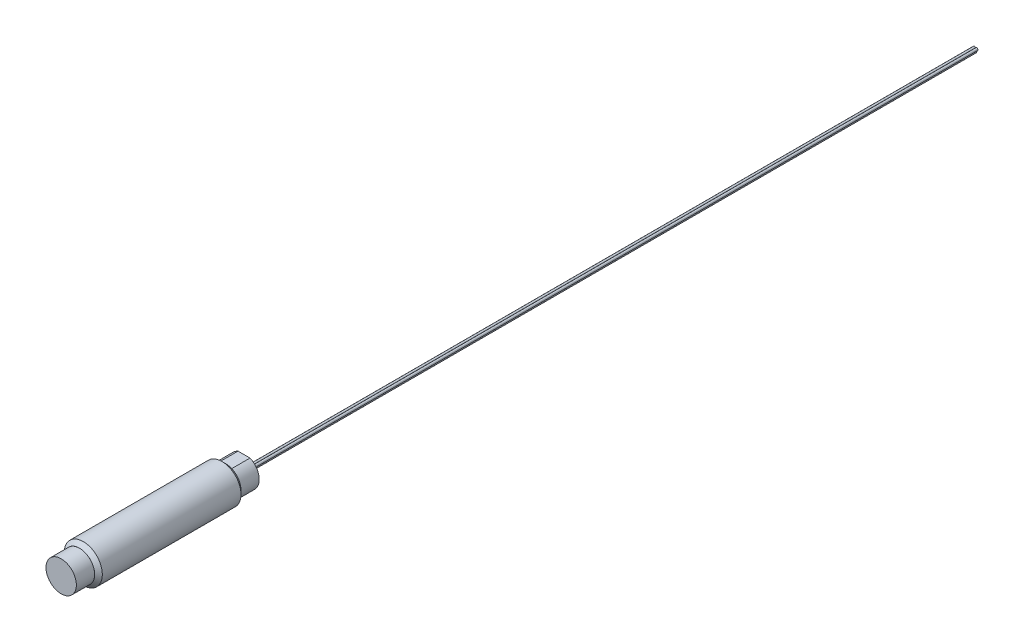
ISO-10303-21;
HEADER;
FILE_DESCRIPTION(('STEP AP214'),'2;1');
FILE_NAME('part.step','',(''),(''),'','','');
FILE_SCHEMA(('AUTOMOTIVE_DESIGN { 1 0 10303 214 1 1 1 1 }'));
ENDSEC;
DATA;
#1=APPLICATION_CONTEXT('core data for automotive mechanical design processes');
#2=APPLICATION_PROTOCOL_DEFINITION('international standard','automotive_design',2000,#1);
#3=PRODUCT_CONTEXT('',#1,'mechanical');
#4=PRODUCT('Part','Part','',(#3));
#5=PRODUCT_RELATED_PRODUCT_CATEGORY('part','',(#4));
#6=PRODUCT_DEFINITION_FORMATION('','',#4);
#7=PRODUCT_DEFINITION_CONTEXT('part definition',#1,'design');
#8=PRODUCT_DEFINITION('design','',#6,#7);
#9=PRODUCT_DEFINITION_SHAPE('','',#8);
#10=(LENGTH_UNIT() NAMED_UNIT(*) SI_UNIT(.MILLI.,.METRE.));
#11=(NAMED_UNIT(*) PLANE_ANGLE_UNIT() SI_UNIT($,.RADIAN.));
#12=(NAMED_UNIT(*) SI_UNIT($,.STERADIAN.) SOLID_ANGLE_UNIT());
#13=UNCERTAINTY_MEASURE_WITH_UNIT(LENGTH_MEASURE(1.E-05),#10,'distance_accuracy_value','');
#14=(GEOMETRIC_REPRESENTATION_CONTEXT(3) GLOBAL_UNCERTAINTY_ASSIGNED_CONTEXT((#13)) GLOBAL_UNIT_ASSIGNED_CONTEXT((#10,
#11,#12)) REPRESENTATION_CONTEXT('',''));
#15=CARTESIAN_POINT('',(0.,0.,0.));
#16=DIRECTION('',(0.,0.,1.));
#17=DIRECTION('',(1.,0.,0.));
#18=AXIS2_PLACEMENT_3D('',#15,#16,#17);
#19=CARTESIAN_POINT('',(0.,-3.96875,-38.1));
#20=DIRECTION('',(0.,0.,1.));
#21=DIRECTION('',(1.,0.,0.));
#22=AXIS2_PLACEMENT_3D('',#19,#20,#21);
#23=CYLINDRICAL_SURFACE('',#22,3.96875);
#24=CARTESIAN_POINT('',(0.,-3.96875,-33.49625));
#25=DIRECTION('',(0.,0.,-1.));
#26=DIRECTION('',(-1.,0.,0.));
#27=AXIS2_PLACEMENT_3D('',#24,#25,#26);
#28=CIRCLE('',#27,3.96875);
#29=CARTESIAN_POINT('',(3.96875,-3.96875,-33.49625));
#30=VERTEX_POINT('',#29);
#31=EDGE_CURVE('E125',#30,#30,#28,.F.);
#32=CARTESIAN_POINT('',(0.,-3.96875,-4.60375));
#33=DIRECTION('',(0.,0.,1.));
#34=DIRECTION('',(1.,0.,0.));
#35=AXIS2_PLACEMENT_3D('',#32,#33,#34);
#36=CIRCLE('',#35,3.96875);
#37=CARTESIAN_POINT('',(3.96875,-3.96875,-4.60375));
#38=VERTEX_POINT('',#37);
#39=EDGE_CURVE('E122',#38,#38,#36,.F.);
#40=CARTESIAN_POINT('',(3.96875,-3.96875,-33.49625));
#41=CARTESIAN_POINT('',(3.96875,-3.96875,-33.1952864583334));
#42=CARTESIAN_POINT('',(3.96875,-3.96875,-32.8943229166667));
#43=CARTESIAN_POINT('',(3.96875,-3.96875,-32.2923958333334));
#44=CARTESIAN_POINT('',(3.96875,-3.96875,-31.9914322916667));
#45=CARTESIAN_POINT('',(3.96875,-3.96875,-31.3895052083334));
#46=CARTESIAN_POINT('',(3.96875,-3.96875,-31.0885416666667));
#47=CARTESIAN_POINT('',(3.96875,-3.96875,-30.4866145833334));
#48=CARTESIAN_POINT('',(3.96875,-3.96875,-30.1856510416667));
#49=CARTESIAN_POINT('',(3.96875,-3.96875,-29.5837239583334));
#50=CARTESIAN_POINT('',(3.96875,-3.96875,-29.2827604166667));
#51=CARTESIAN_POINT('',(3.96875,-3.96875,-28.6808333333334));
#52=CARTESIAN_POINT('',(3.96875,-3.96875,-28.3798697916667));
#53=CARTESIAN_POINT('',(3.96875,-3.96875,-27.7779427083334));
#54=CARTESIAN_POINT('',(3.96875,-3.96875,-27.4769791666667));
#55=CARTESIAN_POINT('',(3.96875,-3.96875,-26.8750520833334));
#56=CARTESIAN_POINT('',(3.96875,-3.96875,-26.5740885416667));
#57=CARTESIAN_POINT('',(3.96875,-3.96875,-25.9721614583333));
#58=CARTESIAN_POINT('',(3.96875,-3.96875,-25.6711979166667));
#59=CARTESIAN_POINT('',(3.96875,-3.96875,-25.0692708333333));
#60=CARTESIAN_POINT('',(3.96875,-3.96875,-24.7683072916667));
#61=CARTESIAN_POINT('',(3.96875,-3.96875,-24.1663802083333));
#62=CARTESIAN_POINT('',(3.96875,-3.96875,-23.8654166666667));
#63=CARTESIAN_POINT('',(3.96875,-3.96875,-23.2634895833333));
#64=CARTESIAN_POINT('',(3.96875,-3.96875,-22.9625260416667));
#65=CARTESIAN_POINT('',(3.96875,-3.96875,-22.3605989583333));
#66=CARTESIAN_POINT('',(3.96875,-3.96875,-22.0596354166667));
#67=CARTESIAN_POINT('',(3.96875,-3.96875,-21.4577083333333));
#68=CARTESIAN_POINT('',(3.96875,-3.96875,-21.1567447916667));
#69=CARTESIAN_POINT('',(3.96875,-3.96875,-20.5548177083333));
#70=CARTESIAN_POINT('',(3.96875,-3.96875,-20.2538541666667));
#71=CARTESIAN_POINT('',(3.96875,-3.96875,-19.6519270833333));
#72=CARTESIAN_POINT('',(3.96875,-3.96875,-19.3509635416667));
#73=CARTESIAN_POINT('',(3.96875,-3.96875,-18.7490364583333));
#74=CARTESIAN_POINT('',(3.96875,-3.96875,-18.4480729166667));
#75=CARTESIAN_POINT('',(3.96875,-3.96875,-17.8461458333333));
#76=CARTESIAN_POINT('',(3.96875,-3.96875,-17.5451822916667));
#77=CARTESIAN_POINT('',(3.96875,-3.96875,-16.9432552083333));
#78=CARTESIAN_POINT('',(3.96875,-3.96875,-16.6422916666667));
#79=CARTESIAN_POINT('',(3.96875,-3.96875,-16.0403645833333));
#80=CARTESIAN_POINT('',(3.96875,-3.96875,-15.7394010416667));
#81=CARTESIAN_POINT('',(3.96875,-3.96875,-15.1374739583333));
#82=CARTESIAN_POINT('',(3.96875,-3.96875,-14.8365104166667));
#83=CARTESIAN_POINT('',(3.96875,-3.96875,-14.2345833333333));
#84=CARTESIAN_POINT('',(3.96875,-3.96875,-13.9336197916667));
#85=CARTESIAN_POINT('',(3.96875,-3.96875,-13.3316927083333));
#86=CARTESIAN_POINT('',(3.96875,-3.96875,-13.0307291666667));
#87=CARTESIAN_POINT('',(3.96875,-3.96875,-12.4288020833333));
#88=CARTESIAN_POINT('',(3.96875,-3.96875,-12.1278385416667));
#89=CARTESIAN_POINT('',(3.96875,-3.96875,-11.5259114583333));
#90=CARTESIAN_POINT('',(3.96875,-3.96875,-11.2249479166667));
#91=CARTESIAN_POINT('',(3.96875,-3.96875,-10.6230208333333));
#92=CARTESIAN_POINT('',(3.96875,-3.96875,-10.3220572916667));
#93=CARTESIAN_POINT('',(3.96875,-3.96875,-9.72013020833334));
#94=CARTESIAN_POINT('',(3.96875,-3.96875,-9.41916666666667));
#95=CARTESIAN_POINT('',(3.96875,-3.96875,-8.81723958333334));
#96=CARTESIAN_POINT('',(3.96875,-3.96875,-8.51627604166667));
#97=CARTESIAN_POINT('',(3.96875,-3.96875,-7.91434895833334));
#98=CARTESIAN_POINT('',(3.96875,-3.96875,-7.61338541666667));
#99=CARTESIAN_POINT('',(3.96875,-3.96875,-7.01145833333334));
#100=CARTESIAN_POINT('',(3.96875,-3.96875,-6.71049479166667));
#101=CARTESIAN_POINT('',(3.96875,-3.96875,-6.10856770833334));
#102=CARTESIAN_POINT('',(3.96875,-3.96875,-5.80760416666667));
#103=CARTESIAN_POINT('',(3.96875,-3.96875,-5.20567708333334));
#104=CARTESIAN_POINT('',(3.96875,-3.96875,-4.90471354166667));
#105=CARTESIAN_POINT('',(3.96875,-3.96875,-4.60375));
#106=B_SPLINE_CURVE_WITH_KNOTS('',3,(#40,#41,#42,#43,#44,#45,#46,#47,#48,#49,#50,#51,#52,#53,
#54,#55,#56,#57,#58,#59,#60,#61,#62,#63,#64,#65,#66,#67,#68,#69,#70,#71,#72,#73,#74,#75,#76,#77,
#78,#79,#80,#81,#82,#83,#84,#85,#86,#87,#88,#89,#90,#91,#92,#93,#94,#95,#96,#97,#98,#99,#100,
#101,#102,#103,#104,#105),.UNSPECIFIED.,.F.,.F.,(4,2,2,2,2,2,2,2,2,2,2,2,2,2,2,2,2,2,2,2,2,2,2,
2,2,2,2,2,2,2,2,2,4),(0.,0.902890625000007,1.80578125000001,2.70867187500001,3.61156250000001,
4.514453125,5.41734375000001,6.32023437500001,7.22312500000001,8.12601562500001,
9.02890625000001,9.93179687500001,10.8346875,11.737578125,12.64046875,13.543359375,14.44625,
15.349140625,16.25203125,17.154921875,18.0578125,18.960703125,19.86359375,20.766484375,
21.669375,22.572265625,23.47515625,24.378046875,25.2809375,26.183828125,27.08671875,
27.989609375,28.8925),.UNSPECIFIED.);
#107=EDGE_CURVE('BSEAM33',#30,#38,#106,.T.);
#108=ORIENTED_EDGE('',*,*,#31,.T.);
#109=ORIENTED_EDGE('',*,*,#39,.T.);
#110=ORIENTED_EDGE('',*,*,#107,.T.);
#111=ORIENTED_EDGE('',*,*,#107,.F.);
#112=EDGE_LOOP('',(#108,#110,#109,#111));
#113=FACE_BOUND('',#112,.T.);
#114=ADVANCED_FACE('F33',(#113),#23,.T.);
#115=CARTESIAN_POINT('',(0.,-3.96875,-3.81));
#116=DIRECTION('',(0.,0.,1.));
#117=DIRECTION('',(1.,0.,0.));
#118=AXIS2_PLACEMENT_3D('',#115,#116,#117);
#119=PLANE('',#118);
#120=CARTESIAN_POINT('',(0.,-3.96875,-3.81));
#121=DIRECTION('',(0.,0.,1.));
#122=DIRECTION('',(1.,0.,0.));
#123=AXIS2_PLACEMENT_3D('',#120,#121,#122);
#124=CIRCLE('',#123,3.175);
#125=CARTESIAN_POINT('',(3.175,-3.96875,-3.81));
#126=VERTEX_POINT('',#125);
#127=EDGE_CURVE('E128',#126,#126,#124,.T.);
#128=ORIENTED_EDGE('',*,*,#127,.T.);
#129=EDGE_LOOP('',(#128));
#130=FACE_BOUND('',#129,.T.);
#131=CARTESIAN_POINT('',(0.,-3.96875,-3.81));
#132=DIRECTION('',(0.,0.,1.));
#133=DIRECTION('',(1.,0.,0.));
#134=AXIS2_PLACEMENT_3D('',#131,#132,#133);
#135=CIRCLE('',#134,3.16677439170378);
#136=CARTESIAN_POINT('',(3.16677439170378,-3.96875,-3.81));
#137=VERTEX_POINT('',#136);
#138=EDGE_CURVE('E114',#137,#137,#135,.T.);
#139=ORIENTED_EDGE('',*,*,#138,.F.);
#140=EDGE_LOOP('',(#139));
#141=FACE_BOUND('',#140,.T.);
#142=ADVANCED_FACE('F159',(#130,#141),#119,.T.);
#143=CARTESIAN_POINT('',(0.,-3.96875,-3.81));
#144=DIRECTION('',(0.,0.,1.));
#145=DIRECTION('',(1.,0.,0.));
#146=AXIS2_PLACEMENT_3D('',#143,#144,#145);
#147=CYLINDRICAL_SURFACE('',#146,3.16677439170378);
#148=CARTESIAN_POINT('',(0.,-3.96875,0.));
#149=DIRECTION('',(0.,0.,1.));
#150=DIRECTION('',(1.,0.,0.));
#151=AXIS2_PLACEMENT_3D('',#148,#149,#150);
#152=CIRCLE('',#151,3.16677439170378);
#153=CARTESIAN_POINT('',(3.16677439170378,-3.96875,0.));
#154=VERTEX_POINT('',#153);
#155=EDGE_CURVE('E110',#154,#154,#152,.T.);
#156=CARTESIAN_POINT('',(3.16677439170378,-3.96875,-3.81));
#157=CARTESIAN_POINT('',(3.16677439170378,-3.96875,-3.7703125));
#158=CARTESIAN_POINT('',(3.16677439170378,-3.96875,-3.730625));
#159=CARTESIAN_POINT('',(3.16677439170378,-3.96875,-3.65125));
#160=CARTESIAN_POINT('',(3.16677439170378,-3.96875,-3.6115625));
#161=CARTESIAN_POINT('',(3.16677439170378,-3.96875,-3.5321875));
#162=CARTESIAN_POINT('',(3.16677439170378,-3.96875,-3.4925));
#163=CARTESIAN_POINT('',(3.16677439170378,-3.96875,-3.413125));
#164=CARTESIAN_POINT('',(3.16677439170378,-3.96875,-3.3734375));
#165=CARTESIAN_POINT('',(3.16677439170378,-3.96875,-3.2940625));
#166=CARTESIAN_POINT('',(3.16677439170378,-3.96875,-3.254375));
#167=CARTESIAN_POINT('',(3.16677439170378,-3.96875,-3.175));
#168=CARTESIAN_POINT('',(3.16677439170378,-3.96875,-3.1353125));
#169=CARTESIAN_POINT('',(3.16677439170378,-3.96875,-3.0559375));
#170=CARTESIAN_POINT('',(3.16677439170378,-3.96875,-3.01625));
#171=CARTESIAN_POINT('',(3.16677439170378,-3.96875,-2.936875));
#172=CARTESIAN_POINT('',(3.16677439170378,-3.96875,-2.8971875));
#173=CARTESIAN_POINT('',(3.16677439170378,-3.96875,-2.8178125));
#174=CARTESIAN_POINT('',(3.16677439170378,-3.96875,-2.778125));
#175=CARTESIAN_POINT('',(3.16677439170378,-3.96875,-2.69875));
#176=CARTESIAN_POINT('',(3.16677439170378,-3.96875,-2.6590625));
#177=CARTESIAN_POINT('',(3.16677439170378,-3.96875,-2.5796875));
#178=CARTESIAN_POINT('',(3.16677439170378,-3.96875,-2.54));
#179=CARTESIAN_POINT('',(3.16677439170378,-3.96875,-2.460625));
#180=CARTESIAN_POINT('',(3.16677439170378,-3.96875,-2.4209375));
#181=CARTESIAN_POINT('',(3.16677439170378,-3.96875,-2.3415625));
#182=CARTESIAN_POINT('',(3.16677439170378,-3.96875,-2.301875));
#183=CARTESIAN_POINT('',(3.16677439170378,-3.96875,-2.2225));
#184=CARTESIAN_POINT('',(3.16677439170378,-3.96875,-2.1828125));
#185=CARTESIAN_POINT('',(3.16677439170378,-3.96875,-2.1034375));
#186=CARTESIAN_POINT('',(3.16677439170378,-3.96875,-2.06375));
#187=CARTESIAN_POINT('',(3.16677439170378,-3.96875,-1.984375));
#188=CARTESIAN_POINT('',(3.16677439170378,-3.96875,-1.9446875));
#189=CARTESIAN_POINT('',(3.16677439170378,-3.96875,-1.8653125));
#190=CARTESIAN_POINT('',(3.16677439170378,-3.96875,-1.825625));
#191=CARTESIAN_POINT('',(3.16677439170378,-3.96875,-1.74625));
#192=CARTESIAN_POINT('',(3.16677439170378,-3.96875,-1.7065625));
#193=CARTESIAN_POINT('',(3.16677439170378,-3.96875,-1.6271875));
#194=CARTESIAN_POINT('',(3.16677439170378,-3.96875,-1.5875));
#195=CARTESIAN_POINT('',(3.16677439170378,-3.96875,-1.508125));
#196=CARTESIAN_POINT('',(3.16677439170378,-3.96875,-1.4684375));
#197=CARTESIAN_POINT('',(3.16677439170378,-3.96875,-1.3890625));
#198=CARTESIAN_POINT('',(3.16677439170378,-3.96875,-1.349375));
#199=CARTESIAN_POINT('',(3.16677439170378,-3.96875,-1.27));
#200=CARTESIAN_POINT('',(3.16677439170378,-3.96875,-1.2303125));
#201=CARTESIAN_POINT('',(3.16677439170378,-3.96875,-1.1509375));
#202=CARTESIAN_POINT('',(3.16677439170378,-3.96875,-1.11125));
#203=CARTESIAN_POINT('',(3.16677439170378,-3.96875,-1.031875));
#204=CARTESIAN_POINT('',(3.16677439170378,-3.96875,-0.9921875));
#205=CARTESIAN_POINT('',(3.16677439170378,-3.96875,-0.9128125));
#206=CARTESIAN_POINT('',(3.16677439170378,-3.96875,-0.873125));
#207=CARTESIAN_POINT('',(3.16677439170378,-3.96875,-0.79375));
#208=CARTESIAN_POINT('',(3.16677439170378,-3.96875,-0.7540625));
#209=CARTESIAN_POINT('',(3.16677439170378,-3.96875,-0.6746875));
#210=CARTESIAN_POINT('',(3.16677439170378,-3.96875,-0.635));
#211=CARTESIAN_POINT('',(3.16677439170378,-3.96875,-0.555625));
#212=CARTESIAN_POINT('',(3.16677439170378,-3.96875,-0.5159375));
#213=CARTESIAN_POINT('',(3.16677439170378,-3.96875,-0.4365625));
#214=CARTESIAN_POINT('',(3.16677439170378,-3.96875,-0.396875));
#215=CARTESIAN_POINT('',(3.16677439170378,-3.96875,-0.3175));
#216=CARTESIAN_POINT('',(3.16677439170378,-3.96875,-0.2778125));
#217=CARTESIAN_POINT('',(3.16677439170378,-3.96875,-0.1984375));
#218=CARTESIAN_POINT('',(3.16677439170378,-3.96875,-0.15875));
#219=CARTESIAN_POINT('',(3.16677439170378,-3.96875,-0.0793750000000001));
#220=CARTESIAN_POINT('',(3.16677439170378,-3.96875,-0.0396875));
#221=CARTESIAN_POINT('',(3.16677439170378,-3.96875,0.));
#222=B_SPLINE_CURVE_WITH_KNOTS('',3,(#156,#157,#158,#159,#160,#161,#162,#163,#164,#165,#166,
#167,#168,#169,#170,#171,#172,#173,#174,#175,#176,#177,#178,#179,#180,#181,#182,#183,#184,#185,
#186,#187,#188,#189,#190,#191,#192,#193,#194,#195,#196,#197,#198,#199,#200,#201,#202,#203,#204,
#205,#206,#207,#208,#209,#210,#211,#212,#213,#214,#215,#216,#217,#218,#219,#220,#221),
.UNSPECIFIED.,.F.,.F.,(4,2,2,2,2,2,2,2,2,2,2,2,2,2,2,2,2,2,2,2,2,2,2,2,2,2,2,2,2,2,2,2,4),(0.,
0.1190625,0.238125,0.3571875,0.47625,0.5953125,0.714375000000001,0.8334375,0.9525,1.0715625,
1.190625,1.3096875,1.42875,1.5478125,1.666875,1.7859375,1.905,2.0240625,2.143125,2.2621875,
2.38125,2.5003125,2.619375,2.7384375,2.8575,2.9765625,3.095625,3.2146875,3.33375,3.4528125,
3.571875,3.6909375,3.81),.UNSPECIFIED.);
#223=EDGE_CURVE('BSEAM165',#137,#154,#222,.T.);
#224=ORIENTED_EDGE('',*,*,#138,.T.);
#225=ORIENTED_EDGE('',*,*,#155,.F.);
#226=ORIENTED_EDGE('',*,*,#223,.T.);
#227=ORIENTED_EDGE('',*,*,#223,.F.);
#228=EDGE_LOOP('',(#224,#226,#225,#227));
#229=FACE_BOUND('',#228,.T.);
#230=ADVANCED_FACE('F165',(#229),#147,.T.);
#231=CARTESIAN_POINT('',(0.,-3.96875,0.));
#232=DIRECTION('',(0.,0.,1.));
#233=DIRECTION('',(1.,0.,0.));
#234=AXIS2_PLACEMENT_3D('',#231,#232,#233);
#235=PLANE('',#234);
#236=ORIENTED_EDGE('',*,*,#155,.T.);
#237=EDGE_LOOP('',(#236));
#238=FACE_BOUND('',#237,.T.);
#239=ADVANCED_FACE('F170',(#238),#235,.T.);
#240=CARTESIAN_POINT('',(0.,-3.96875,-34.29));
#241=DIRECTION('',(0.,0.,-1.));
#242=DIRECTION('',(-1.,0.,0.));
#243=AXIS2_PLACEMENT_3D('',#240,#241,#242);
#244=PLANE('',#243);
#245=CARTESIAN_POINT('',(0.,-3.96875,-34.29));
#246=DIRECTION('',(0.,0.,-1.));
#247=DIRECTION('',(-1.,0.,0.));
#248=AXIS2_PLACEMENT_3D('',#245,#246,#247);
#249=CIRCLE('',#248,3.17500000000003);
#250=CARTESIAN_POINT('',(-3.17500000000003,-3.96875,-34.29));
#251=VERTEX_POINT('',#250);
#252=EDGE_CURVE('E117',#251,#251,#249,.T.);
#253=ORIENTED_EDGE('',*,*,#252,.T.);
#254=EDGE_LOOP('',(#253));
#255=FACE_BOUND('',#254,.T.);
#256=DIRECTION('',(1.,0.,0.));
#257=VECTOR('',#256,1.);
#258=CARTESIAN_POINT('',(1.24817261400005,-1.05833333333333,-34.29));
#259=LINE('',#258,#257);
#260=CARTESIAN_POINT('',(-1.24817261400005,-1.05833333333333,-34.29));
#261=VERTEX_POINT('',#260);
#262=CARTESIAN_POINT('',(1.24817261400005,-1.05833333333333,-34.29));
#263=VERTEX_POINT('',#262);
#264=EDGE_CURVE('E86',#261,#263,#259,.T.);
#265=ORIENTED_EDGE('',*,*,#264,.F.);
#266=CARTESIAN_POINT('',(0.,-3.96875,-34.29));
#267=DIRECTION('',(0.,0.,-1.));
#268=DIRECTION('',(1.,0.,0.));
#269=AXIS2_PLACEMENT_3D('',#266,#267,#268);
#270=CIRCLE('',#269,3.16677439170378);
#271=CARTESIAN_POINT('',(-1.24817261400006,-6.87916666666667,-34.29));
#272=VERTEX_POINT('',#271);
#273=EDGE_CURVE('E56',#272,#261,#270,.T.);
#274=ORIENTED_EDGE('',*,*,#273,.F.);
#275=DIRECTION('',(-1.,0.,0.));
#276=VECTOR('',#275,1.);
#277=CARTESIAN_POINT('',(1.24817261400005,-6.87916666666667,-34.29));
#278=LINE('',#277,#276);
#279=CARTESIAN_POINT('',(1.24817261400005,-6.87916666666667,-34.29));
#280=VERTEX_POINT('',#279);
#281=EDGE_CURVE('E78',#280,#272,#278,.T.);
#282=ORIENTED_EDGE('',*,*,#281,.F.);
#283=CARTESIAN_POINT('',(0.,-3.96875,-34.29));
#284=DIRECTION('',(0.,0.,-1.));
#285=DIRECTION('',(-1.,0.,0.));
#286=AXIS2_PLACEMENT_3D('',#283,#284,#285);
#287=CIRCLE('',#286,3.16677439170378);
#288=EDGE_CURVE('E90',#263,#280,#287,.T.);
#289=ORIENTED_EDGE('',*,*,#288,.F.);
#290=EDGE_LOOP('',(#265,#274,#282,#289));
#291=FACE_BOUND('',#290,.T.);
#292=ADVANCED_FACE('F89',(#255,#291),#244,.T.);
#293=CARTESIAN_POINT('',(0.,-3.96875,-34.29));
#294=DIRECTION('',(0.,0.,-1.));
#295=DIRECTION('',(-1.,0.,0.));
#296=AXIS2_PLACEMENT_3D('',#293,#294,#295);
#297=CYLINDRICAL_SURFACE('',#296,3.16677439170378);
#298=CARTESIAN_POINT('',(0.,-3.96875,-38.1));
#299=DIRECTION('',(0.,0.,-1.));
#300=DIRECTION('',(-1.,0.,0.));
#301=AXIS2_PLACEMENT_3D('',#298,#299,#300);
#302=CIRCLE('',#301,3.16677439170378);
#303=CARTESIAN_POINT('',(1.24817261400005,-1.05833333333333,-38.1));
#304=VERTEX_POINT('',#303);
#305=CARTESIAN_POINT('',(1.24817261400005,-6.87916666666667,-38.1));
#306=VERTEX_POINT('',#305);
#307=EDGE_CURVE('E105',#304,#306,#302,.T.);
#308=ORIENTED_EDGE('',*,*,#307,.F.);
#309=DIRECTION('',(0.,0.,-1.));
#310=VECTOR('',#309,1.);
#311=CARTESIAN_POINT('',(1.24817261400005,-1.05833333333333,-34.29));
#312=LINE('',#311,#310);
#313=EDGE_CURVE('E94',#263,#304,#312,.T.);
#314=ORIENTED_EDGE('',*,*,#313,.F.);
#315=ORIENTED_EDGE('',*,*,#288,.T.);
#316=DIRECTION('',(0.,0.,-1.));
#317=VECTOR('',#316,1.);
#318=CARTESIAN_POINT('',(1.24817261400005,-6.87916666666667,-34.29));
#319=LINE('',#318,#317);
#320=EDGE_CURVE('E76',#280,#306,#319,.T.);
#321=ORIENTED_EDGE('',*,*,#320,.T.);
#322=EDGE_LOOP('',(#308,#314,#315,#321));
#323=FACE_BOUND('',#322,.T.);
#324=ADVANCED_FACE('F93',(#323),#297,.T.);
#325=CARTESIAN_POINT('',(1.24817261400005,-1.05833333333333,-34.29));
#326=DIRECTION('',(0.,1.,0.));
#327=DIRECTION('',(-1.,0.,0.));
#328=AXIS2_PLACEMENT_3D('',#325,#326,#327);
#329=PLANE('',#328);
#330=DIRECTION('',(1.,0.,0.));
#331=VECTOR('',#330,1.);
#332=CARTESIAN_POINT('',(1.24817261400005,-1.05833333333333,-38.1));
#333=LINE('',#332,#331);
#334=CARTESIAN_POINT('',(-1.24817261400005,-1.05833333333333,-38.1));
#335=VERTEX_POINT('',#334);
#336=EDGE_CURVE('E95',#335,#304,#333,.T.);
#337=ORIENTED_EDGE('',*,*,#336,.F.);
#338=DIRECTION('',(0.,0.,-1.));
#339=VECTOR('',#338,1.);
#340=CARTESIAN_POINT('',(-1.24817261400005,-1.05833333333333,-34.29));
#341=LINE('',#340,#339);
#342=EDGE_CURVE('E111',#261,#335,#341,.T.);
#343=ORIENTED_EDGE('',*,*,#342,.F.);
#344=ORIENTED_EDGE('',*,*,#264,.T.);
#345=ORIENTED_EDGE('',*,*,#313,.T.);
#346=EDGE_LOOP('',(#337,#343,#344,#345));
#347=FACE_BOUND('',#346,.T.);
#348=ADVANCED_FACE('F148',(#347),#329,.T.);
#349=CARTESIAN_POINT('',(0.,-3.96875,-34.29));
#350=DIRECTION('',(0.,0.,-1.));
#351=DIRECTION('',(-1.,0.,0.));
#352=AXIS2_PLACEMENT_3D('',#349,#350,#351);
#353=CYLINDRICAL_SURFACE('',#352,3.16677439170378);
#354=CARTESIAN_POINT('',(0.,-3.96875,-38.1));
#355=DIRECTION('',(0.,0.,-1.));
#356=DIRECTION('',(1.,0.,0.));
#357=AXIS2_PLACEMENT_3D('',#354,#355,#356);
#358=CIRCLE('',#357,3.16677439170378);
#359=CARTESIAN_POINT('',(-1.24817261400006,-6.87916666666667,-38.1));
#360=VERTEX_POINT('',#359);
#361=EDGE_CURVE('E48',#360,#335,#358,.T.);
#362=ORIENTED_EDGE('',*,*,#361,.F.);
#363=DIRECTION('',(0.,0.,-1.));
#364=VECTOR('',#363,1.);
#365=CARTESIAN_POINT('',(-1.24817261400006,-6.87916666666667,-34.29));
#366=LINE('',#365,#364);
#367=EDGE_CURVE('E85',#272,#360,#366,.T.);
#368=ORIENTED_EDGE('',*,*,#367,.F.);
#369=ORIENTED_EDGE('',*,*,#273,.T.);
#370=ORIENTED_EDGE('',*,*,#342,.T.);
#371=EDGE_LOOP('',(#362,#368,#369,#370));
#372=FACE_BOUND('',#371,.T.);
#373=ADVANCED_FACE('F149',(#372),#353,.T.);
#374=CARTESIAN_POINT('',(1.24817261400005,-6.87916666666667,-34.29));
#375=DIRECTION('',(0.,-1.,0.));
#376=DIRECTION('',(0.,0.,-1.));
#377=AXIS2_PLACEMENT_3D('',#374,#375,#376);
#378=PLANE('',#377);
#379=DIRECTION('',(-1.,0.,0.));
#380=VECTOR('',#379,1.);
#381=CARTESIAN_POINT('',(1.24817261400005,-6.87916666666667,-38.1));
#382=LINE('',#381,#380);
#383=EDGE_CURVE('E80',#306,#360,#382,.T.);
#384=ORIENTED_EDGE('',*,*,#383,.F.);
#385=ORIENTED_EDGE('',*,*,#320,.F.);
#386=ORIENTED_EDGE('',*,*,#281,.T.);
#387=ORIENTED_EDGE('',*,*,#367,.T.);
#388=EDGE_LOOP('',(#384,#385,#386,#387));
#389=FACE_BOUND('',#388,.T.);
#390=ADVANCED_FACE('F77',(#389),#378,.T.);
#391=CARTESIAN_POINT('',(0.,-3.96875,-38.1));
#392=DIRECTION('',(0.,0.,1.));
#393=DIRECTION('',(1.,0.,0.));
#394=AXIS2_PLACEMENT_3D('',#391,#392,#393);
#395=PLANE('',#394);
#396=CARTESIAN_POINT('',(0.00254999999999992,-4.48384999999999,-38.1));
#397=DIRECTION('',(0.,0.,1.));
#398=DIRECTION('',(1.,0.,0.));
#399=AXIS2_PLACEMENT_3D('',#396,#397,#398);
#400=CIRCLE('',#399,0.254999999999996);
#401=CARTESIAN_POINT('',(0.257549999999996,-4.48384999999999,-38.1));
#402=VERTEX_POINT('',#401);
#403=EDGE_CURVE('E11',#402,#402,#400,.F.);
#404=ORIENTED_EDGE('',*,*,#403,.F.);
#405=EDGE_LOOP('',(#404));
#406=FACE_BOUND('',#405,.T.);
#407=CARTESIAN_POINT('',(-0.257549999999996,-3.96875,-38.1));
#408=DIRECTION('',(0.,0.,1.));
#409=DIRECTION('',(1.,0.,0.));
#410=AXIS2_PLACEMENT_3D('',#407,#408,#409);
#411=CIRCLE('',#410,0.254999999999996);
#412=CARTESIAN_POINT('',(-0.00254999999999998,-3.96875,-38.1));
#413=VERTEX_POINT('',#412);
#414=EDGE_CURVE('E41',#413,#413,#411,.F.);
#415=ORIENTED_EDGE('',*,*,#414,.F.);
#416=EDGE_LOOP('',(#415));
#417=FACE_BOUND('',#416,.T.);
#418=CARTESIAN_POINT('',(0.257549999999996,-3.96875,-38.1));
#419=DIRECTION('',(0.,0.,1.));
#420=DIRECTION('',(1.,0.,0.));
#421=AXIS2_PLACEMENT_3D('',#418,#419,#420);
#422=CIRCLE('',#421,0.254999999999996);
#423=CARTESIAN_POINT('',(0.512549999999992,-3.96875,-38.1));
#424=VERTEX_POINT('',#423);
#425=EDGE_CURVE('E131',#424,#424,#422,.F.);
#426=ORIENTED_EDGE('',*,*,#425,.F.);
#427=EDGE_LOOP('',(#426));
#428=FACE_BOUND('',#427,.T.);
#429=ORIENTED_EDGE('',*,*,#307,.T.);
#430=ORIENTED_EDGE('',*,*,#383,.T.);
#431=ORIENTED_EDGE('',*,*,#361,.T.);
#432=ORIENTED_EDGE('',*,*,#336,.T.);
#433=EDGE_LOOP('',(#429,#430,#431,#432));
#434=FACE_BOUND('',#433,.T.);
#435=ADVANCED_FACE('F138',(#406,#417,#428,#434),#395,.F.);
#436=CARTESIAN_POINT('',(0.,-3.96875,-34.29));
#437=DIRECTION('',(0.,0.,1.));
#438=DIRECTION('',(1.,0.,0.));
#439=AXIS2_PLACEMENT_3D('',#436,#437,#438);
#440=CONICAL_SURFACE('',#439,3.17500000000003,0.785398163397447);
#441=ORIENTED_EDGE('',*,*,#31,.F.);
#442=EDGE_LOOP('',(#441));
#443=FACE_BOUND('',#442,.T.);
#444=ORIENTED_EDGE('',*,*,#252,.F.);
#445=EDGE_LOOP('',(#444));
#446=FACE_BOUND('',#445,.T.);
#447=ADVANCED_FACE('F141',(#443,#446),#440,.T.);
#448=CARTESIAN_POINT('',(0.,-3.96875,-3.81));
#449=DIRECTION('',(0.,0.,-1.));
#450=DIRECTION('',(-1.,0.,0.));
#451=AXIS2_PLACEMENT_3D('',#448,#449,#450);
#452=CONICAL_SURFACE('',#451,3.175,0.785398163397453);
#453=ORIENTED_EDGE('',*,*,#39,.F.);
#454=EDGE_LOOP('',(#453));
#455=FACE_BOUND('',#454,.T.);
#456=ORIENTED_EDGE('',*,*,#127,.F.);
#457=EDGE_LOOP('',(#456));
#458=FACE_BOUND('',#457,.T.);
#459=ADVANCED_FACE('F35',(#455,#458),#452,.T.);
#460=CARTESIAN_POINT('',(0.257549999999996,-3.96875,-190.5));
#461=DIRECTION('',(0.,0.,1.));
#462=DIRECTION('',(1.,0.,0.));
#463=AXIS2_PLACEMENT_3D('',#460,#461,#462);
#464=CYLINDRICAL_SURFACE('',#463,0.254999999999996);
#465=CARTESIAN_POINT('',(0.257549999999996,-3.96875,-190.5));
#466=DIRECTION('',(0.,0.,-1.));
#467=DIRECTION('',(-1.,0.,0.));
#468=AXIS2_PLACEMENT_3D('',#465,#466,#467);
#469=CIRCLE('',#468,0.254999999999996);
#470=CARTESIAN_POINT('',(0.00254999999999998,-3.96875,-190.5));
#471=VERTEX_POINT('',#470);
#472=EDGE_CURVE('E100',#471,#471,#469,.T.);
#473=ORIENTED_EDGE('',*,*,#472,.F.);
#474=EDGE_LOOP('',(#473));
#475=FACE_BOUND('',#474,.T.);
#476=ORIENTED_EDGE('',*,*,#425,.T.);
#477=EDGE_LOOP('',(#476));
#478=FACE_BOUND('',#477,.T.);
#479=ADVANCED_FACE('F176',(#475,#478),#464,.T.);
#480=CARTESIAN_POINT('',(0.257549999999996,-3.96875,-190.5));
#481=DIRECTION('',(0.,0.,-1.));
#482=DIRECTION('',(-1.,0.,0.));
#483=AXIS2_PLACEMENT_3D('',#480,#481,#482);
#484=PLANE('',#483);
#485=ORIENTED_EDGE('',*,*,#472,.T.);
#486=EDGE_LOOP('',(#485));
#487=FACE_BOUND('',#486,.T.);
#488=ADVANCED_FACE('F264',(#487),#484,.T.);
#489=CARTESIAN_POINT('',(-0.257549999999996,-3.96875,-190.5));
#490=DIRECTION('',(0.,0.,1.));
#491=DIRECTION('',(1.,0.,0.));
#492=AXIS2_PLACEMENT_3D('',#489,#490,#491);
#493=CYLINDRICAL_SURFACE('',#492,0.254999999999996);
#494=CARTESIAN_POINT('',(-0.257549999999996,-3.96875,-190.5));
#495=DIRECTION('',(0.,0.,-1.));
#496=DIRECTION('',(-1.,0.,0.));
#497=AXIS2_PLACEMENT_3D('',#494,#495,#496);
#498=CIRCLE('',#497,0.254999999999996);
#499=CARTESIAN_POINT('',(-0.512549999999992,-3.96875,-190.5));
#500=VERTEX_POINT('',#499);
#501=EDGE_CURVE('E320',#500,#500,#498,.T.);
#502=ORIENTED_EDGE('',*,*,#501,.F.);
#503=EDGE_LOOP('',(#502));
#504=FACE_BOUND('',#503,.T.);
#505=ORIENTED_EDGE('',*,*,#414,.T.);
#506=EDGE_LOOP('',(#505));
#507=FACE_BOUND('',#506,.T.);
#508=ADVANCED_FACE('F136',(#504,#507),#493,.T.);
#509=CARTESIAN_POINT('',(-0.257549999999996,-3.96875,-190.5));
#510=DIRECTION('',(0.,0.,-1.));
#511=DIRECTION('',(-1.,0.,0.));
#512=AXIS2_PLACEMENT_3D('',#509,#510,#511);
#513=PLANE('',#512);
#514=ORIENTED_EDGE('',*,*,#501,.T.);
#515=EDGE_LOOP('',(#514));
#516=FACE_BOUND('',#515,.T.);
#517=ADVANCED_FACE('F283',(#516),#513,.T.);
#518=CARTESIAN_POINT('',(0.00254999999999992,-4.48384999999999,-190.5));
#519=DIRECTION('',(0.,0.,1.));
#520=DIRECTION('',(1.,0.,0.));
#521=AXIS2_PLACEMENT_3D('',#518,#519,#520);
#522=CYLINDRICAL_SURFACE('',#521,0.254999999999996);
#523=CARTESIAN_POINT('',(0.00254999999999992,-4.48384999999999,-190.5));
#524=DIRECTION('',(0.,0.,-1.));
#525=DIRECTION('',(-1.,0.,0.));
#526=AXIS2_PLACEMENT_3D('',#523,#524,#525);
#527=CIRCLE('',#526,0.254999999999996);
#528=CARTESIAN_POINT('',(-0.252449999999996,-4.48384999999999,-190.5));
#529=VERTEX_POINT('',#528);
#530=EDGE_CURVE('E319',#529,#529,#527,.T.);
#531=ORIENTED_EDGE('',*,*,#530,.F.);
#532=EDGE_LOOP('',(#531));
#533=FACE_BOUND('',#532,.T.);
#534=ORIENTED_EDGE('',*,*,#403,.T.);
#535=EDGE_LOOP('',(#534));
#536=FACE_BOUND('',#535,.T.);
#537=ADVANCED_FACE('F293',(#533,#536),#522,.T.);
#538=CARTESIAN_POINT('',(0.00254999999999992,-4.48384999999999,-190.5));
#539=DIRECTION('',(0.,0.,-1.));
#540=DIRECTION('',(-1.,0.,0.));
#541=AXIS2_PLACEMENT_3D('',#538,#539,#540);
#542=PLANE('',#541);
#543=ORIENTED_EDGE('',*,*,#530,.T.);
#544=EDGE_LOOP('',(#543));
#545=FACE_BOUND('',#544,.T.);
#546=ADVANCED_FACE('F303',(#545),#542,.T.);
#547=CLOSED_SHELL('',(#114,#142,#230,#239,#292,#324,#348,#373,#390,#435,#447,#459,#479,#488,
#508,#517,#537,#546));
#548=MANIFOLD_SOLID_BREP('B2',#547);
#549=ADVANCED_BREP_SHAPE_REPRESENTATION('',(#18,#548),#14);
#550=SHAPE_DEFINITION_REPRESENTATION(#9,#549);
ENDSEC;
END-ISO-10303-21;
